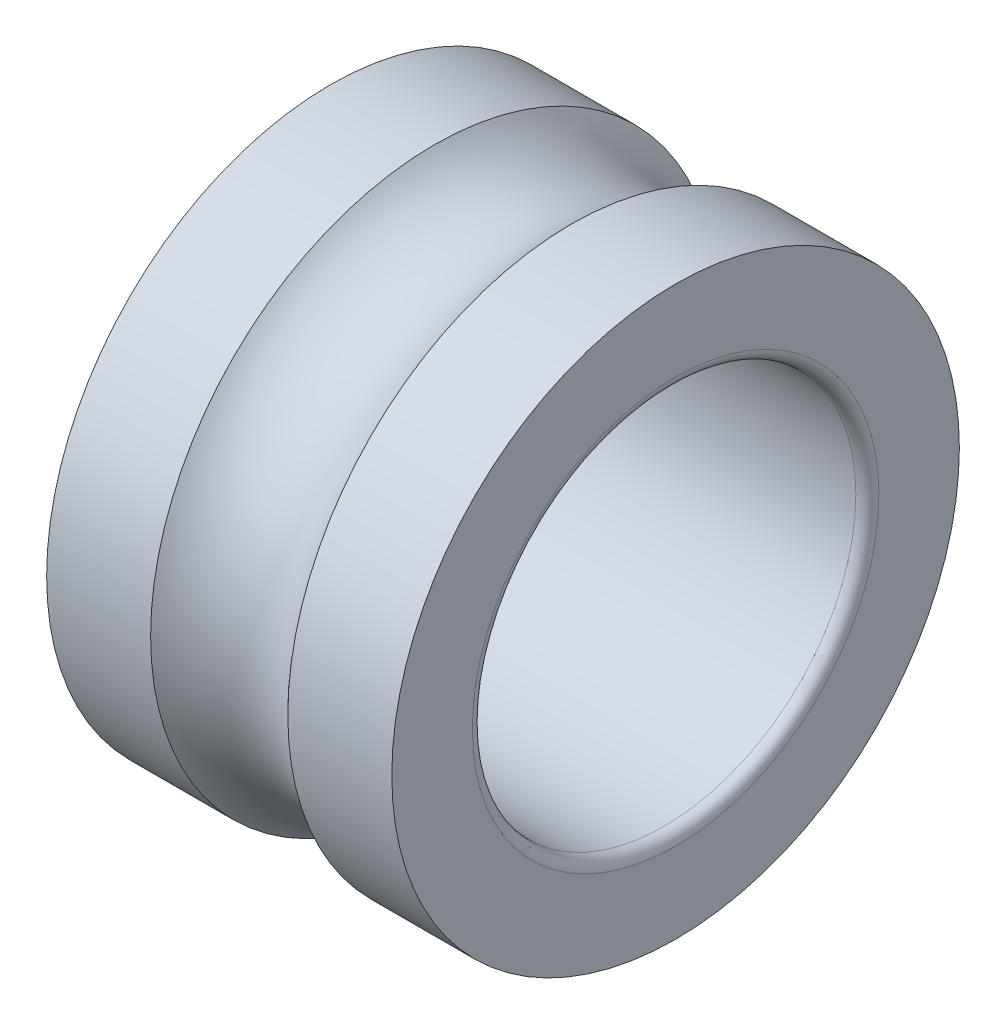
from build123d import *


with BuildPart() as part:
    # Esquisse1 → Base-R_volution (revolve)
    with BuildSketch(Plane(origin=(0, 0, 0), x_dir=(1, 0, 0), z_dir=(0, 1, 0)), mode=Mode.PRIVATE) as base_r_volution_sk:
        with BuildLine():
            Line((0, 7.4), (0, 5.3))
            ThreePointArc((0, 5.3), (0.087867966, 5.087867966), (0.3, 5))
            Line((0.3, 5), (8.7, 5))
            ThreePointArc((8.7, 5), (8.912132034, 5.087867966), (9, 5.3))
            Line((9, 5.3), (9, 7.4))
            Line((9, 7.4), (6.288854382, 7.4))
            ThreePointArc((6.288854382, 7.4), (4.5, 6.6), (2.711145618, 7.4))
            Line((2.711145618, 7.4), (0, 7.4))
        make_face()
    revolve(base_r_volution_sk.sketch.rotate(Axis((0, 0, 0), (1, 0, 0)), 180), axis=Axis((0, 0, 0), (1, 0, 0)))


solid = part.part
